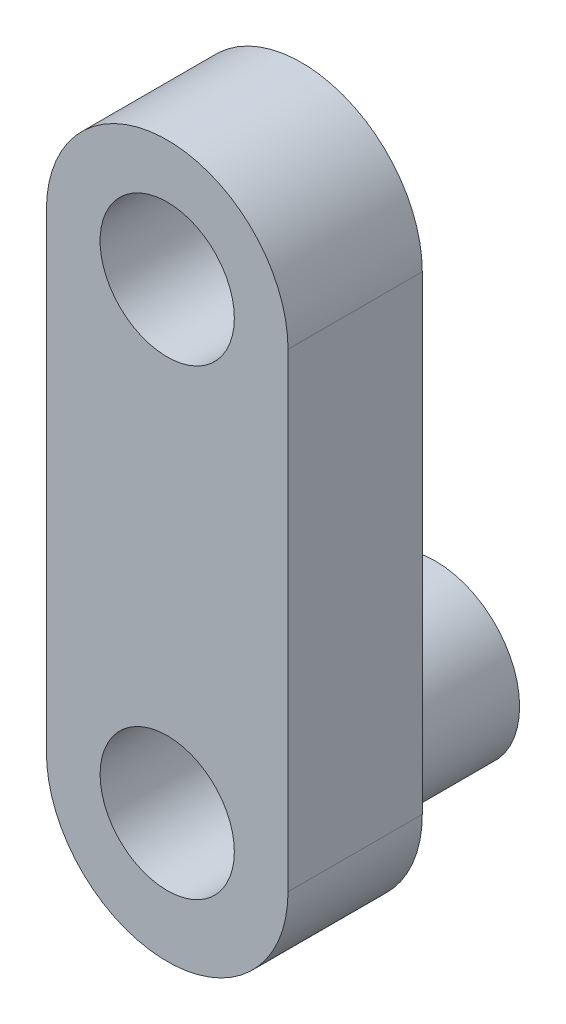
ISO-10303-21;
HEADER;
FILE_DESCRIPTION(('STEP AP214'),'2;1');
FILE_NAME('part.step','',(''),(''),'','','');
FILE_SCHEMA(('AUTOMOTIVE_DESIGN { 1 0 10303 214 1 1 1 1 }'));
ENDSEC;
DATA;
#1=APPLICATION_CONTEXT('core data for automotive mechanical design processes');
#2=APPLICATION_PROTOCOL_DEFINITION('international standard','automotive_design',2000,#1);
#3=PRODUCT_CONTEXT('',#1,'mechanical');
#4=PRODUCT('Part','Part','',(#3));
#5=PRODUCT_RELATED_PRODUCT_CATEGORY('part','',(#4));
#6=PRODUCT_DEFINITION_FORMATION('','',#4);
#7=PRODUCT_DEFINITION_CONTEXT('part definition',#1,'design');
#8=PRODUCT_DEFINITION('design','',#6,#7);
#9=PRODUCT_DEFINITION_SHAPE('','',#8);
#10=(LENGTH_UNIT() NAMED_UNIT(*) SI_UNIT(.MILLI.,.METRE.));
#11=(NAMED_UNIT(*) PLANE_ANGLE_UNIT() SI_UNIT($,.RADIAN.));
#12=(NAMED_UNIT(*) SI_UNIT($,.STERADIAN.) SOLID_ANGLE_UNIT());
#13=UNCERTAINTY_MEASURE_WITH_UNIT(LENGTH_MEASURE(1.E-05),#10,'distance_accuracy_value','');
#14=(GEOMETRIC_REPRESENTATION_CONTEXT(3) GLOBAL_UNCERTAINTY_ASSIGNED_CONTEXT((#13)) GLOBAL_UNIT_ASSIGNED_CONTEXT((#10,
#11,#12)) REPRESENTATION_CONTEXT('',''));
#15=CARTESIAN_POINT('',(0.,0.,0.));
#16=DIRECTION('',(0.,0.,1.));
#17=DIRECTION('',(1.,0.,0.));
#18=AXIS2_PLACEMENT_3D('',#15,#16,#17);
#19=CARTESIAN_POINT('',(0.,70.,-10.));
#20=DIRECTION('',(0.,0.,1.));
#21=DIRECTION('',(1.,0.,0.));
#22=AXIS2_PLACEMENT_3D('',#19,#20,#21);
#23=PLANE('',#22);
#24=CARTESIAN_POINT('',(0.,70.,-10.));
#25=DIRECTION('',(0.,0.,1.));
#26=DIRECTION('',(1.,0.,0.));
#27=AXIS2_PLACEMENT_3D('',#24,#25,#26);
#28=CIRCLE('',#27,10.);
#29=CARTESIAN_POINT('',(10.,70.,-10.));
#30=VERTEX_POINT('',#29);
#31=EDGE_CURVE('E221',#30,#30,#28,.T.);
#32=ORIENTED_EDGE('',*,*,#31,.T.);
#33=EDGE_LOOP('',(#32));
#34=FACE_BOUND('',#33,.T.);
#35=CARTESIAN_POINT('',(0.,70.,-10.));
#36=DIRECTION('',(0.,0.,1.));
#37=DIRECTION('',(1.,0.,0.));
#38=AXIS2_PLACEMENT_3D('',#35,#36,#37);
#39=CIRCLE('',#38,18.);
#40=CARTESIAN_POINT('',(18.,70.,-10.));
#41=VERTEX_POINT('',#40);
#42=CARTESIAN_POINT('',(-18.,70.,-10.));
#43=VERTEX_POINT('',#42);
#44=EDGE_CURVE('E108',#41,#43,#39,.T.);
#45=ORIENTED_EDGE('',*,*,#44,.F.);
#46=DIRECTION('',(0.,1.,0.));
#47=VECTOR('',#46,1.);
#48=CARTESIAN_POINT('',(18.,70.,-10.));
#49=LINE('',#48,#47);
#50=CARTESIAN_POINT('',(18.,0.,-10.));
#51=VERTEX_POINT('',#50);
#52=EDGE_CURVE('E80',#51,#41,#49,.T.);
#53=ORIENTED_EDGE('',*,*,#52,.F.);
#54=CARTESIAN_POINT('',(0.,0.,-10.));
#55=DIRECTION('',(0.,0.,1.));
#56=DIRECTION('',(1.,0.,0.));
#57=AXIS2_PLACEMENT_3D('',#54,#55,#56);
#58=CIRCLE('',#57,18.);
#59=CARTESIAN_POINT('',(-18.,0.,-10.));
#60=VERTEX_POINT('',#59);
#61=EDGE_CURVE('E74',#60,#51,#58,.T.);
#62=ORIENTED_EDGE('',*,*,#61,.F.);
#63=DIRECTION('',(0.,-1.,0.));
#64=VECTOR('',#63,1.);
#65=CARTESIAN_POINT('',(-18.,70.,-10.));
#66=LINE('',#65,#64);
#67=EDGE_CURVE('E99',#43,#60,#66,.T.);
#68=ORIENTED_EDGE('',*,*,#67,.F.);
#69=EDGE_LOOP('',(#45,#53,#62,#68));
#70=FACE_BOUND('',#69,.T.);
#71=CARTESIAN_POINT('',(0.,1.15384615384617,-10.));
#72=DIRECTION('',(0.,0.,1.));
#73=DIRECTION('',(1.,0.,0.));
#74=AXIS2_PLACEMENT_3D('',#71,#72,#73);
#75=CIRCLE('',#74,12.5);
#76=CARTESIAN_POINT('',(12.5,1.15384615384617,-10.));
#77=VERTEX_POINT('',#76);
#78=EDGE_CURVE('E11',#77,#77,#75,.F.);
#79=ORIENTED_EDGE('',*,*,#78,.F.);
#80=EDGE_LOOP('',(#79));
#81=FACE_BOUND('',#80,.T.);
#82=ADVANCED_FACE('F40',(#34,#70,#81),#23,.F.);
#83=CARTESIAN_POINT('',(0.,70.,10.));
#84=DIRECTION('',(0.,0.,1.));
#85=DIRECTION('',(1.,0.,0.));
#86=AXIS2_PLACEMENT_3D('',#83,#84,#85);
#87=PLANE('',#86);
#88=CARTESIAN_POINT('',(0.,1.15384615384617,10.));
#89=DIRECTION('',(0.,0.,1.));
#90=DIRECTION('',(1.,0.,0.));
#91=AXIS2_PLACEMENT_3D('',#88,#89,#90);
#92=CIRCLE('',#91,10.);
#93=CARTESIAN_POINT('',(10.,1.15384615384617,10.));
#94=VERTEX_POINT('',#93);
#95=EDGE_CURVE('E111',#94,#94,#92,.T.);
#96=ORIENTED_EDGE('',*,*,#95,.F.);
#97=EDGE_LOOP('',(#96));
#98=FACE_BOUND('',#97,.T.);
#99=CARTESIAN_POINT('',(0.,70.,10.));
#100=DIRECTION('',(0.,0.,1.));
#101=DIRECTION('',(1.,0.,0.));
#102=AXIS2_PLACEMENT_3D('',#99,#100,#101);
#103=CIRCLE('',#102,18.);
#104=CARTESIAN_POINT('',(18.,70.,10.));
#105=VERTEX_POINT('',#104);
#106=CARTESIAN_POINT('',(-18.,70.,10.));
#107=VERTEX_POINT('',#106);
#108=EDGE_CURVE('E94',#105,#107,#103,.T.);
#109=ORIENTED_EDGE('',*,*,#108,.T.);
#110=DIRECTION('',(0.,-1.,0.));
#111=VECTOR('',#110,1.);
#112=CARTESIAN_POINT('',(-18.,70.,10.));
#113=LINE('',#112,#111);
#114=CARTESIAN_POINT('',(-18.,0.,10.));
#115=VERTEX_POINT('',#114);
#116=EDGE_CURVE('E88',#107,#115,#113,.T.);
#117=ORIENTED_EDGE('',*,*,#116,.T.);
#118=CARTESIAN_POINT('',(0.,0.,10.));
#119=DIRECTION('',(0.,0.,1.));
#120=DIRECTION('',(1.,0.,0.));
#121=AXIS2_PLACEMENT_3D('',#118,#119,#120);
#122=CIRCLE('',#121,18.);
#123=CARTESIAN_POINT('',(18.,0.,10.));
#124=VERTEX_POINT('',#123);
#125=EDGE_CURVE('E92',#115,#124,#122,.T.);
#126=ORIENTED_EDGE('',*,*,#125,.T.);
#127=DIRECTION('',(0.,1.,0.));
#128=VECTOR('',#127,1.);
#129=CARTESIAN_POINT('',(18.,70.,10.));
#130=LINE('',#129,#128);
#131=EDGE_CURVE('E57',#124,#105,#130,.T.);
#132=ORIENTED_EDGE('',*,*,#131,.T.);
#133=EDGE_LOOP('',(#109,#117,#126,#132));
#134=FACE_BOUND('',#133,.T.);
#135=CARTESIAN_POINT('',(0.,70.,10.));
#136=DIRECTION('',(0.,0.,1.));
#137=DIRECTION('',(1.,0.,0.));
#138=AXIS2_PLACEMENT_3D('',#135,#136,#137);
#139=CIRCLE('',#138,10.);
#140=CARTESIAN_POINT('',(10.,70.,10.));
#141=VERTEX_POINT('',#140);
#142=EDGE_CURVE('E218',#141,#141,#139,.T.);
#143=ORIENTED_EDGE('',*,*,#142,.F.);
#144=EDGE_LOOP('',(#143));
#145=FACE_BOUND('',#144,.T.);
#146=ADVANCED_FACE('F89',(#98,#134,#145),#87,.T.);
#147=CARTESIAN_POINT('',(0.,70.,10.));
#148=DIRECTION('',(0.,0.,-1.));
#149=DIRECTION('',(-1.,0.,0.));
#150=AXIS2_PLACEMENT_3D('',#147,#148,#149);
#151=CYLINDRICAL_SURFACE('',#150,18.);
#152=ORIENTED_EDGE('',*,*,#44,.T.);
#153=DIRECTION('',(0.,0.,-1.));
#154=VECTOR('',#153,1.);
#155=CARTESIAN_POINT('',(-18.,70.,10.));
#156=LINE('',#155,#154);
#157=EDGE_CURVE('E49',#107,#43,#156,.T.);
#158=ORIENTED_EDGE('',*,*,#157,.F.);
#159=ORIENTED_EDGE('',*,*,#108,.F.);
#160=DIRECTION('',(0.,0.,-1.));
#161=VECTOR('',#160,1.);
#162=CARTESIAN_POINT('',(18.,70.,10.));
#163=LINE('',#162,#161);
#164=EDGE_CURVE('E104',#105,#41,#163,.T.);
#165=ORIENTED_EDGE('',*,*,#164,.T.);
#166=EDGE_LOOP('',(#152,#158,#159,#165));
#167=FACE_BOUND('',#166,.T.);
#168=ADVANCED_FACE('F42',(#167),#151,.T.);
#169=CARTESIAN_POINT('',(-18.,70.,10.));
#170=DIRECTION('',(1.,0.,0.));
#171=DIRECTION('',(0.,1.,0.));
#172=AXIS2_PLACEMENT_3D('',#169,#170,#171);
#173=PLANE('',#172);
#174=ORIENTED_EDGE('',*,*,#67,.T.);
#175=DIRECTION('',(0.,0.,-1.));
#176=VECTOR('',#175,1.);
#177=CARTESIAN_POINT('',(-18.,0.,10.));
#178=LINE('',#177,#176);
#179=EDGE_CURVE('E97',#115,#60,#178,.T.);
#180=ORIENTED_EDGE('',*,*,#179,.F.);
#181=ORIENTED_EDGE('',*,*,#116,.F.);
#182=ORIENTED_EDGE('',*,*,#157,.T.);
#183=EDGE_LOOP('',(#174,#180,#181,#182));
#184=FACE_BOUND('',#183,.T.);
#185=ADVANCED_FACE('F98',(#184),#173,.F.);
#186=CARTESIAN_POINT('',(0.,0.,10.));
#187=DIRECTION('',(0.,0.,-1.));
#188=DIRECTION('',(-1.,0.,0.));
#189=AXIS2_PLACEMENT_3D('',#186,#187,#188);
#190=CYLINDRICAL_SURFACE('',#189,18.);
#191=ORIENTED_EDGE('',*,*,#61,.T.);
#192=DIRECTION('',(0.,0.,-1.));
#193=VECTOR('',#192,1.);
#194=CARTESIAN_POINT('',(18.,0.,10.));
#195=LINE('',#194,#193);
#196=EDGE_CURVE('E100',#124,#51,#195,.T.);
#197=ORIENTED_EDGE('',*,*,#196,.F.);
#198=ORIENTED_EDGE('',*,*,#125,.F.);
#199=ORIENTED_EDGE('',*,*,#179,.T.);
#200=EDGE_LOOP('',(#191,#197,#198,#199));
#201=FACE_BOUND('',#200,.T.);
#202=ADVANCED_FACE('F102',(#201),#190,.T.);
#203=CARTESIAN_POINT('',(18.,70.,10.));
#204=DIRECTION('',(-1.,0.,0.));
#205=DIRECTION('',(0.,-1.,0.));
#206=AXIS2_PLACEMENT_3D('',#203,#204,#205);
#207=PLANE('',#206);
#208=ORIENTED_EDGE('',*,*,#52,.T.);
#209=ORIENTED_EDGE('',*,*,#164,.F.);
#210=ORIENTED_EDGE('',*,*,#131,.F.);
#211=ORIENTED_EDGE('',*,*,#196,.T.);
#212=EDGE_LOOP('',(#208,#209,#210,#211));
#213=FACE_BOUND('',#212,.T.);
#214=ADVANCED_FACE('F144',(#213),#207,.F.);
#215=CARTESIAN_POINT('',(0.,1.15384615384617,10.));
#216=DIRECTION('',(0.,0.,-1.));
#217=DIRECTION('',(-1.,0.,0.));
#218=AXIS2_PLACEMENT_3D('',#215,#216,#217);
#219=CYLINDRICAL_SURFACE('',#218,10.);
#220=ORIENTED_EDGE('',*,*,#95,.T.);
#221=EDGE_LOOP('',(#220));
#222=FACE_BOUND('',#221,.T.);
#223=CARTESIAN_POINT('',(0.,1.15384615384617,-30.));
#224=DIRECTION('',(0.,0.,-1.));
#225=DIRECTION('',(-1.,0.,0.));
#226=AXIS2_PLACEMENT_3D('',#223,#224,#225);
#227=CIRCLE('',#226,10.);
#228=CARTESIAN_POINT('',(-10.,1.15384615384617,-30.));
#229=VERTEX_POINT('',#228);
#230=EDGE_CURVE('E229',#229,#229,#227,.T.);
#231=ORIENTED_EDGE('',*,*,#230,.T.);
#232=EDGE_LOOP('',(#231));
#233=FACE_BOUND('',#232,.T.);
#234=ADVANCED_FACE('F140',(#222,#233),#219,.F.);
#235=CARTESIAN_POINT('',(0.,70.,10.));
#236=DIRECTION('',(0.,0.,-1.));
#237=DIRECTION('',(-1.,0.,0.));
#238=AXIS2_PLACEMENT_3D('',#235,#236,#237);
#239=CYLINDRICAL_SURFACE('',#238,10.);
#240=ORIENTED_EDGE('',*,*,#142,.T.);
#241=EDGE_LOOP('',(#240));
#242=FACE_BOUND('',#241,.T.);
#243=ORIENTED_EDGE('',*,*,#31,.F.);
#244=EDGE_LOOP('',(#243));
#245=FACE_BOUND('',#244,.T.);
#246=ADVANCED_FACE('F133',(#242,#245),#239,.F.);
#247=CARTESIAN_POINT('',(0.,1.15384615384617,-30.));
#248=DIRECTION('',(0.,0.,-1.));
#249=DIRECTION('',(-1.,0.,0.));
#250=AXIS2_PLACEMENT_3D('',#247,#248,#249);
#251=PLANE('',#250);
#252=CARTESIAN_POINT('',(0.,1.15384615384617,-30.));
#253=DIRECTION('',(0.,0.,-1.));
#254=DIRECTION('',(-1.,0.,0.));
#255=AXIS2_PLACEMENT_3D('',#252,#253,#254);
#256=CIRCLE('',#255,12.5);
#257=CARTESIAN_POINT('',(-12.5,1.15384615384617,-30.));
#258=VERTEX_POINT('',#257);
#259=EDGE_CURVE('E225',#258,#258,#256,.T.);
#260=ORIENTED_EDGE('',*,*,#259,.T.);
#261=EDGE_LOOP('',(#260));
#262=FACE_BOUND('',#261,.T.);
#263=ORIENTED_EDGE('',*,*,#230,.F.);
#264=EDGE_LOOP('',(#263));
#265=FACE_BOUND('',#264,.T.);
#266=ADVANCED_FACE('F127',(#262,#265),#251,.T.);
#267=CARTESIAN_POINT('',(0.,1.15384615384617,-30.));
#268=DIRECTION('',(0.,0.,1.));
#269=DIRECTION('',(1.,0.,0.));
#270=AXIS2_PLACEMENT_3D('',#267,#268,#269);
#271=CYLINDRICAL_SURFACE('',#270,12.5);
#272=ORIENTED_EDGE('',*,*,#259,.F.);
#273=EDGE_LOOP('',(#272));
#274=FACE_BOUND('',#273,.T.);
#275=ORIENTED_EDGE('',*,*,#78,.T.);
#276=EDGE_LOOP('',(#275));
#277=FACE_BOUND('',#276,.T.);
#278=ADVANCED_FACE('F125',(#274,#277),#271,.T.);
#279=CLOSED_SHELL('',(#82,#146,#168,#185,#202,#214,#234,#246,#266,#278));
#280=MANIFOLD_SOLID_BREP('B2',#279);
#281=ADVANCED_BREP_SHAPE_REPRESENTATION('',(#18,#280),#14);
#282=SHAPE_DEFINITION_REPRESENTATION(#9,#281);
ENDSEC;
END-ISO-10303-21;
